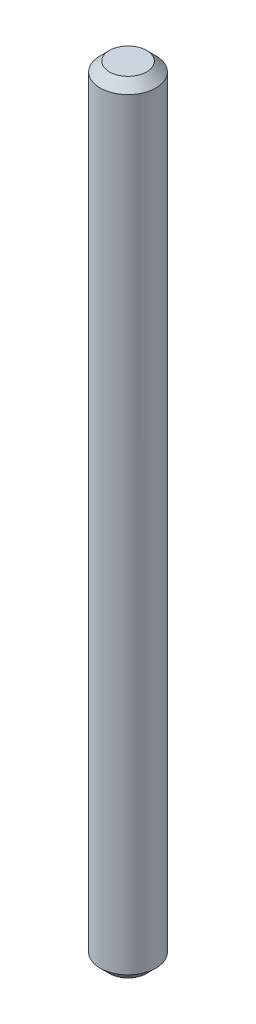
ISO-10303-21;
HEADER;
FILE_DESCRIPTION(('STEP AP214'),'2;1');
FILE_NAME('part.step','',(''),(''),'','','');
FILE_SCHEMA(('AUTOMOTIVE_DESIGN { 1 0 10303 214 1 1 1 1 }'));
ENDSEC;
DATA;
#1=APPLICATION_CONTEXT('core data for automotive mechanical design processes');
#2=APPLICATION_PROTOCOL_DEFINITION('international standard','automotive_design',2000,#1);
#3=PRODUCT_CONTEXT('',#1,'mechanical');
#4=PRODUCT('Part','Part','',(#3));
#5=PRODUCT_RELATED_PRODUCT_CATEGORY('part','',(#4));
#6=PRODUCT_DEFINITION_FORMATION('','',#4);
#7=PRODUCT_DEFINITION_CONTEXT('part definition',#1,'design');
#8=PRODUCT_DEFINITION('design','',#6,#7);
#9=PRODUCT_DEFINITION_SHAPE('','',#8);
#10=(LENGTH_UNIT() NAMED_UNIT(*) SI_UNIT(.MILLI.,.METRE.));
#11=(NAMED_UNIT(*) PLANE_ANGLE_UNIT() SI_UNIT($,.RADIAN.));
#12=(NAMED_UNIT(*) SI_UNIT($,.STERADIAN.) SOLID_ANGLE_UNIT());
#13=UNCERTAINTY_MEASURE_WITH_UNIT(LENGTH_MEASURE(1.E-05),#10,'distance_accuracy_value','');
#14=(GEOMETRIC_REPRESENTATION_CONTEXT(3) GLOBAL_UNCERTAINTY_ASSIGNED_CONTEXT((#13)) GLOBAL_UNIT_ASSIGNED_CONTEXT((#10,
#11,#12)) REPRESENTATION_CONTEXT('',''));
#15=CARTESIAN_POINT('',(0.,0.,0.));
#16=DIRECTION('',(0.,0.,1.));
#17=DIRECTION('',(1.,0.,0.));
#18=AXIS2_PLACEMENT_3D('',#15,#16,#17);
#19=CARTESIAN_POINT('',(0.,10.5,0.));
#20=DIRECTION('',(0.,-1.,0.));
#21=DIRECTION('',(0.,0.,-1.));
#22=AXIS2_PLACEMENT_3D('',#19,#20,#21);
#23=CYLINDRICAL_SURFACE('',#22,0.75);
#24=CARTESIAN_POINT('',(0.,-10.25,0.));
#25=DIRECTION('',(0.,1.,0.));
#26=DIRECTION('',(0.,0.,1.));
#27=AXIS2_PLACEMENT_3D('',#24,#25,#26);
#28=CIRCLE('',#27,0.75);
#29=CARTESIAN_POINT('',(0.,-10.25,-0.75));
#30=VERTEX_POINT('',#29);
#31=EDGE_CURVE('E40',#30,#30,#28,.T.);
#32=CARTESIAN_POINT('',(0.,10.25,0.));
#33=DIRECTION('',(0.,1.,0.));
#34=DIRECTION('',(0.,0.,1.));
#35=AXIS2_PLACEMENT_3D('',#32,#33,#34);
#36=CIRCLE('',#35,0.75);
#37=CARTESIAN_POINT('',(0.,10.25,-0.75));
#38=VERTEX_POINT('',#37);
#39=EDGE_CURVE('E44',#38,#38,#36,.F.);
#40=CARTESIAN_POINT('',(0.,-10.25,-0.75));
#41=CARTESIAN_POINT('',(0.,-10.0364583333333,-0.75));
#42=CARTESIAN_POINT('',(0.,-9.82291666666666,-0.75));
#43=CARTESIAN_POINT('',(0.,-9.39583333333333,-0.75));
#44=CARTESIAN_POINT('',(0.,-9.18229166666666,-0.75));
#45=CARTESIAN_POINT('',(0.,-8.75520833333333,-0.75));
#46=CARTESIAN_POINT('',(0.,-8.54166666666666,-0.75));
#47=CARTESIAN_POINT('',(0.,-8.11458333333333,-0.75));
#48=CARTESIAN_POINT('',(0.,-7.90104166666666,-0.75));
#49=CARTESIAN_POINT('',(0.,-7.47395833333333,-0.75));
#50=CARTESIAN_POINT('',(0.,-7.26041666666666,-0.75));
#51=CARTESIAN_POINT('',(0.,-6.83333333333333,-0.75));
#52=CARTESIAN_POINT('',(0.,-6.61979166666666,-0.75));
#53=CARTESIAN_POINT('',(0.,-6.19270833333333,-0.75));
#54=CARTESIAN_POINT('',(0.,-5.97916666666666,-0.75));
#55=CARTESIAN_POINT('',(0.,-5.55208333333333,-0.75));
#56=CARTESIAN_POINT('',(0.,-5.33854166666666,-0.75));
#57=CARTESIAN_POINT('',(0.,-4.91145833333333,-0.75));
#58=CARTESIAN_POINT('',(0.,-4.69791666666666,-0.75));
#59=CARTESIAN_POINT('',(0.,-4.27083333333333,-0.75));
#60=CARTESIAN_POINT('',(0.,-4.05729166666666,-0.75));
#61=CARTESIAN_POINT('',(0.,-3.63020833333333,-0.75));
#62=CARTESIAN_POINT('',(0.,-3.41666666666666,-0.75));
#63=CARTESIAN_POINT('',(0.,-2.98958333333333,-0.75));
#64=CARTESIAN_POINT('',(0.,-2.77604166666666,-0.75));
#65=CARTESIAN_POINT('',(0.,-2.34895833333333,-0.75));
#66=CARTESIAN_POINT('',(0.,-2.13541666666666,-0.75));
#67=CARTESIAN_POINT('',(0.,-1.70833333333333,-0.75));
#68=CARTESIAN_POINT('',(0.,-1.49479166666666,-0.75));
#69=CARTESIAN_POINT('',(0.,-1.06770833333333,-0.75));
#70=CARTESIAN_POINT('',(0.,-0.854166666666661,-0.75));
#71=CARTESIAN_POINT('',(0.,-0.427083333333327,-0.75));
#72=CARTESIAN_POINT('',(0.,-0.21354166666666,-0.75));
#73=CARTESIAN_POINT('',(0.,0.213541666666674,-0.75));
#74=CARTESIAN_POINT('',(0.,0.427083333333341,-0.75));
#75=CARTESIAN_POINT('',(0.,0.854166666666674,-0.75));
#76=CARTESIAN_POINT('',(0.,1.06770833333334,-0.75));
#77=CARTESIAN_POINT('',(0.,1.49479166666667,-0.75));
#78=CARTESIAN_POINT('',(0.,1.70833333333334,-0.75));
#79=CARTESIAN_POINT('',(0.,2.13541666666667,-0.75));
#80=CARTESIAN_POINT('',(0.,2.34895833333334,-0.75));
#81=CARTESIAN_POINT('',(0.,2.77604166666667,-0.75));
#82=CARTESIAN_POINT('',(0.,2.98958333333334,-0.75));
#83=CARTESIAN_POINT('',(0.,3.41666666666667,-0.75));
#84=CARTESIAN_POINT('',(0.,3.63020833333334,-0.75));
#85=CARTESIAN_POINT('',(0.,4.05729166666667,-0.75));
#86=CARTESIAN_POINT('',(0.,4.27083333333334,-0.75));
#87=CARTESIAN_POINT('',(0.,4.69791666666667,-0.75));
#88=CARTESIAN_POINT('',(0.,4.91145833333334,-0.75));
#89=CARTESIAN_POINT('',(0.,5.33854166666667,-0.75));
#90=CARTESIAN_POINT('',(0.,5.55208333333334,-0.75));
#91=CARTESIAN_POINT('',(0.,5.97916666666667,-0.75));
#92=CARTESIAN_POINT('',(0.,6.19270833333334,-0.75));
#93=CARTESIAN_POINT('',(0.,6.61979166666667,-0.75));
#94=CARTESIAN_POINT('',(0.,6.83333333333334,-0.75));
#95=CARTESIAN_POINT('',(0.,7.26041666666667,-0.75));
#96=CARTESIAN_POINT('',(0.,7.47395833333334,-0.75));
#97=CARTESIAN_POINT('',(0.,7.90104166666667,-0.75));
#98=CARTESIAN_POINT('',(0.,8.11458333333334,-0.75));
#99=CARTESIAN_POINT('',(0.,8.54166666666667,-0.75));
#100=CARTESIAN_POINT('',(0.,8.75520833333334,-0.75));
#101=CARTESIAN_POINT('',(0.,9.18229166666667,-0.75));
#102=CARTESIAN_POINT('',(0.,9.39583333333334,-0.75));
#103=CARTESIAN_POINT('',(0.,9.82291666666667,-0.75));
#104=CARTESIAN_POINT('',(0.,10.0364583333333,-0.75));
#105=CARTESIAN_POINT('',(0.,10.25,-0.75));
#106=B_SPLINE_CURVE_WITH_KNOTS('',3,(#40,#41,#42,#43,#44,#45,#46,#47,#48,#49,#50,#51,#52,#53,
#54,#55,#56,#57,#58,#59,#60,#61,#62,#63,#64,#65,#66,#67,#68,#69,#70,#71,#72,#73,#74,#75,#76,#77,
#78,#79,#80,#81,#82,#83,#84,#85,#86,#87,#88,#89,#90,#91,#92,#93,#94,#95,#96,#97,#98,#99,#100,
#101,#102,#103,#104,#105),.UNSPECIFIED.,.F.,.F.,(4,2,2,2,2,2,2,2,2,2,2,2,2,2,2,2,2,2,2,2,2,2,2,
2,2,2,2,2,2,2,2,2,4),(0.,0.640624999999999,1.28125,1.921875,2.5625,3.203125,3.84375,4.484375,
5.125,5.765625,6.40625,7.046875,7.6875,8.328125,8.96875,9.609375,10.25,10.890625,11.53125,
12.171875,12.8125,13.453125,14.09375,14.734375,15.375,16.015625,16.65625,17.296875,17.9375,
18.578125,19.21875,19.859375,20.5),.UNSPECIFIED.);
#107=EDGE_CURVE('BSEAM29',#30,#38,#106,.T.);
#108=ORIENTED_EDGE('',*,*,#31,.T.);
#109=ORIENTED_EDGE('',*,*,#39,.T.);
#110=ORIENTED_EDGE('',*,*,#107,.T.);
#111=ORIENTED_EDGE('',*,*,#107,.F.);
#112=EDGE_LOOP('',(#108,#110,#109,#111));
#113=FACE_BOUND('',#112,.T.);
#114=ADVANCED_FACE('F29',(#113),#23,.T.);
#115=CARTESIAN_POINT('',(0.,10.5,0.));
#116=DIRECTION('',(0.,1.,0.));
#117=DIRECTION('',(0.,0.,1.));
#118=AXIS2_PLACEMENT_3D('',#115,#116,#117);
#119=PLANE('',#118);
#120=CARTESIAN_POINT('',(0.,10.5,0.));
#121=DIRECTION('',(0.,1.,0.));
#122=DIRECTION('',(0.,0.,1.));
#123=AXIS2_PLACEMENT_3D('',#120,#121,#122);
#124=CIRCLE('',#123,0.500000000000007);
#125=CARTESIAN_POINT('',(0.,10.5,0.500000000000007));
#126=VERTEX_POINT('',#125);
#127=EDGE_CURVE('E10',#126,#126,#124,.T.);
#128=ORIENTED_EDGE('',*,*,#127,.T.);
#129=EDGE_LOOP('',(#128));
#130=FACE_BOUND('',#129,.T.);
#131=ADVANCED_FACE('F60',(#130),#119,.T.);
#132=CARTESIAN_POINT('',(0.,-10.5,0.));
#133=DIRECTION('',(0.,1.,0.));
#134=DIRECTION('',(0.,0.,1.));
#135=AXIS2_PLACEMENT_3D('',#132,#133,#134);
#136=PLANE('',#135);
#137=CARTESIAN_POINT('',(0.,-10.5,0.));
#138=DIRECTION('',(0.,1.,0.));
#139=DIRECTION('',(0.,0.,1.));
#140=AXIS2_PLACEMENT_3D('',#137,#138,#139);
#141=CIRCLE('',#140,0.499999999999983);
#142=CARTESIAN_POINT('',(0.,-10.5,0.499999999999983));
#143=VERTEX_POINT('',#142);
#144=EDGE_CURVE('E36',#143,#143,#141,.F.);
#145=ORIENTED_EDGE('',*,*,#144,.T.);
#146=EDGE_LOOP('',(#145));
#147=FACE_BOUND('',#146,.T.);
#148=ADVANCED_FACE('F57',(#147),#136,.F.);
#149=CARTESIAN_POINT('',(0.,-10.25,0.));
#150=DIRECTION('',(0.,1.,0.));
#151=DIRECTION('',(0.,0.,1.));
#152=AXIS2_PLACEMENT_3D('',#149,#150,#151);
#153=CONICAL_SURFACE('',#152,0.75,0.785398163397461);
#154=ORIENTED_EDGE('',*,*,#144,.F.);
#155=EDGE_LOOP('',(#154));
#156=FACE_BOUND('',#155,.T.);
#157=ORIENTED_EDGE('',*,*,#31,.F.);
#158=EDGE_LOOP('',(#157));
#159=FACE_BOUND('',#158,.T.);
#160=ADVANCED_FACE('F53',(#156,#159),#153,.T.);
#161=CARTESIAN_POINT('',(0.,10.5,0.));
#162=DIRECTION('',(0.,-1.,0.));
#163=DIRECTION('',(0.,0.,-1.));
#164=AXIS2_PLACEMENT_3D('',#161,#162,#163);
#165=CONICAL_SURFACE('',#164,0.500000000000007,0.785398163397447);
#166=ORIENTED_EDGE('',*,*,#39,.F.);
#167=EDGE_LOOP('',(#166));
#168=FACE_BOUND('',#167,.T.);
#169=ORIENTED_EDGE('',*,*,#127,.F.);
#170=EDGE_LOOP('',(#169));
#171=FACE_BOUND('',#170,.T.);
#172=ADVANCED_FACE('F31',(#168,#171),#165,.T.);
#173=CLOSED_SHELL('',(#114,#131,#148,#160,#172));
#174=MANIFOLD_SOLID_BREP('B2',#173);
#175=ADVANCED_BREP_SHAPE_REPRESENTATION('',(#18,#174),#14);
#176=SHAPE_DEFINITION_REPRESENTATION(#9,#175);
ENDSEC;
END-ISO-10303-21;
